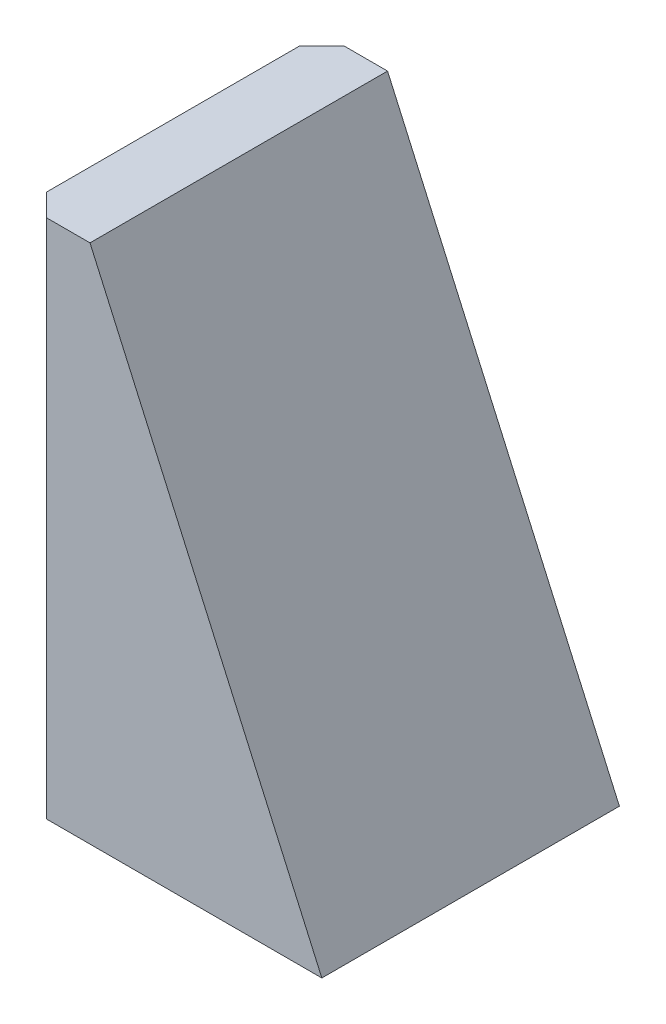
from build123d import *

# Parameters (mm, degrees)
EXTRUDE_1_DEPTH = 4
CHAMFER_1_SIZE  = 0.3


with BuildPart() as part:
    # Sketch 1 → Extrude 1 (new body)
    with BuildSketch(Plane.XY):
        Polygon((0, 0), (4, 0), (0.883399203, 7), (0, 7), align=None)
    extrude(amount=EXTRUDE_1_DEPTH)

    # Chamfer 1
    chamfer_1_edges = [part.edges().sort_by_distance(p)[0] for p in [
        (0, 3.5, 4),
        (0, 3.5, 0),
    ]]
    chamfer(chamfer_1_edges, length=CHAMFER_1_SIZE)


solid = part.part
